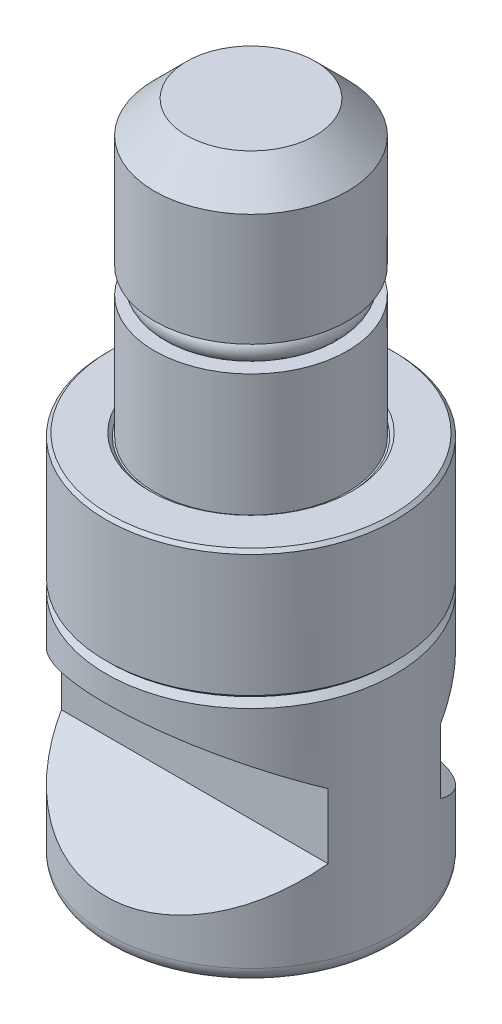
ISO-10303-21;
HEADER;
FILE_DESCRIPTION(('STEP AP214'),'2;1');
FILE_NAME('part.step','',(''),(''),'','','');
FILE_SCHEMA(('AUTOMOTIVE_DESIGN { 1 0 10303 214 1 1 1 1 }'));
ENDSEC;
DATA;
#1=APPLICATION_CONTEXT('core data for automotive mechanical design processes');
#2=APPLICATION_PROTOCOL_DEFINITION('international standard','automotive_design',2000,#1);
#3=PRODUCT_CONTEXT('',#1,'mechanical');
#4=PRODUCT('Part','Part','',(#3));
#5=PRODUCT_RELATED_PRODUCT_CATEGORY('part','',(#4));
#6=PRODUCT_DEFINITION_FORMATION('','',#4);
#7=PRODUCT_DEFINITION_CONTEXT('part definition',#1,'design');
#8=PRODUCT_DEFINITION('design','',#6,#7);
#9=PRODUCT_DEFINITION_SHAPE('','',#8);
#10=(LENGTH_UNIT() NAMED_UNIT(*) SI_UNIT(.MILLI.,.METRE.));
#11=(NAMED_UNIT(*) PLANE_ANGLE_UNIT() SI_UNIT($,.RADIAN.));
#12=(NAMED_UNIT(*) SI_UNIT($,.STERADIAN.) SOLID_ANGLE_UNIT());
#13=UNCERTAINTY_MEASURE_WITH_UNIT(LENGTH_MEASURE(1.E-05),#10,'distance_accuracy_value','');
#14=(GEOMETRIC_REPRESENTATION_CONTEXT(3) GLOBAL_UNCERTAINTY_ASSIGNED_CONTEXT((#13)) GLOBAL_UNIT_ASSIGNED_CONTEXT((#10,
#11,#12)) REPRESENTATION_CONTEXT('',''));
#15=CARTESIAN_POINT('',(0.,0.,0.));
#16=DIRECTION('',(0.,0.,1.));
#17=DIRECTION('',(1.,0.,0.));
#18=AXIS2_PLACEMENT_3D('',#15,#16,#17);
#19=CARTESIAN_POINT('',(6.1,0.,0.));
#20=DIRECTION('',(0.,-1.,0.));
#21=DIRECTION('',(0.,0.,-1.));
#22=AXIS2_PLACEMENT_3D('',#19,#20,#21);
#23=PLANE('',#22);
#24=CARTESIAN_POINT('',(0.,0.,0.));
#25=DIRECTION('',(0.,-1.,0.));
#26=DIRECTION('',(0.,0.,-1.));
#27=AXIS2_PLACEMENT_3D('',#24,#25,#26);
#28=CIRCLE('',#27,8.8);
#29=CARTESIAN_POINT('',(0.,0.,-8.8));
#30=VERTEX_POINT('',#29);
#31=EDGE_CURVE('E292',#30,#30,#28,.T.);
#32=ORIENTED_EDGE('',*,*,#31,.T.);
#33=EDGE_LOOP('',(#32));
#34=FACE_BOUND('',#33,.T.);
#35=CARTESIAN_POINT('',(0.,0.,0.));
#36=DIRECTION('',(0.,1.,0.));
#37=DIRECTION('',(0.,0.,-1.));
#38=AXIS2_PLACEMENT_3D('',#35,#36,#37);
#39=CIRCLE('',#38,8.5);
#40=CARTESIAN_POINT('',(0.,0.,-8.5));
#41=VERTEX_POINT('',#40);
#42=EDGE_CURVE('E177',#41,#41,#39,.T.);
#43=ORIENTED_EDGE('',*,*,#42,.T.);
#44=EDGE_LOOP('',(#43));
#45=FACE_BOUND('',#44,.T.);
#46=ADVANCED_FACE('F16',(#34,#45),#23,.T.);
#47=CARTESIAN_POINT('',(0.,8.,0.));
#48=DIRECTION('',(0.,-1.,0.));
#49=DIRECTION('',(0.,0.,-1.));
#50=AXIS2_PLACEMENT_3D('',#47,#48,#49);
#51=CYLINDRICAL_SURFACE('',#50,9.);
#52=CARTESIAN_POINT('',(0.,0.2,0.));
#53=DIRECTION('',(0.,-1.,0.));
#54=DIRECTION('',(0.,0.,-1.));
#55=AXIS2_PLACEMENT_3D('',#52,#53,#54);
#56=CIRCLE('',#55,9.);
#57=CARTESIAN_POINT('',(0.,0.2,-9.));
#58=VERTEX_POINT('',#57);
#59=EDGE_CURVE('E300',#58,#58,#56,.F.);
#60=ORIENTED_EDGE('',*,*,#59,.T.);
#61=EDGE_LOOP('',(#60));
#62=FACE_BOUND('',#61,.T.);
#63=CARTESIAN_POINT('',(0.,7.8,0.));
#64=DIRECTION('',(0.,1.,0.));
#65=DIRECTION('',(0.,0.,1.));
#66=AXIS2_PLACEMENT_3D('',#63,#64,#65);
#67=CIRCLE('',#66,9.);
#68=CARTESIAN_POINT('',(0.,7.8,9.));
#69=VERTEX_POINT('',#68);
#70=EDGE_CURVE('E288',#69,#69,#67,.F.);
#71=ORIENTED_EDGE('',*,*,#70,.T.);
#72=EDGE_LOOP('',(#71));
#73=FACE_BOUND('',#72,.T.);
#74=ADVANCED_FACE('F257',(#62,#73),#51,.T.);
#75=CARTESIAN_POINT('',(6.1,8.,0.));
#76=DIRECTION('',(0.,1.,0.));
#77=DIRECTION('',(0.,0.,1.));
#78=AXIS2_PLACEMENT_3D('',#75,#76,#77);
#79=PLANE('',#78);
#80=CARTESIAN_POINT('',(0.,8.,0.));
#81=DIRECTION('',(0.,1.,0.));
#82=DIRECTION('',(0.,0.,1.));
#83=AXIS2_PLACEMENT_3D('',#80,#81,#82);
#84=CIRCLE('',#83,8.8);
#85=CARTESIAN_POINT('',(0.,8.,8.8));
#86=VERTEX_POINT('',#85);
#87=EDGE_CURVE('E285',#86,#86,#84,.T.);
#88=ORIENTED_EDGE('',*,*,#87,.T.);
#89=EDGE_LOOP('',(#88));
#90=FACE_BOUND('',#89,.T.);
#91=CARTESIAN_POINT('',(0.,8.,0.));
#92=DIRECTION('',(0.,1.,0.));
#93=DIRECTION('',(0.,0.,1.));
#94=AXIS2_PLACEMENT_3D('',#91,#92,#93);
#95=CIRCLE('',#94,6.3);
#96=CARTESIAN_POINT('',(0.,8.,6.3));
#97=VERTEX_POINT('',#96);
#98=EDGE_CURVE('E295',#97,#97,#95,.F.);
#99=ORIENTED_EDGE('',*,*,#98,.T.);
#100=EDGE_LOOP('',(#99));
#101=FACE_BOUND('',#100,.T.);
#102=ADVANCED_FACE('F264',(#90,#101),#79,.T.);
#103=CARTESIAN_POINT('',(0.,8.,0.));
#104=DIRECTION('',(0.,1.,0.));
#105=DIRECTION('',(0.,0.,1.));
#106=AXIS2_PLACEMENT_3D('',#103,#104,#105);
#107=CONICAL_SURFACE('',#106,6.3,0.785398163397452);
#108=CARTESIAN_POINT('',(0.,7.8,0.));
#109=DIRECTION('',(0.,1.,0.));
#110=DIRECTION('',(0.,0.,1.));
#111=AXIS2_PLACEMENT_3D('',#108,#109,#110);
#112=CIRCLE('',#111,6.1);
#113=CARTESIAN_POINT('',(0.,7.8,6.1));
#114=VERTEX_POINT('',#113);
#115=EDGE_CURVE('E290',#114,#114,#112,.T.);
#116=ORIENTED_EDGE('',*,*,#115,.F.);
#117=EDGE_LOOP('',(#116));
#118=FACE_BOUND('',#117,.T.);
#119=ORIENTED_EDGE('',*,*,#98,.F.);
#120=EDGE_LOOP('',(#119));
#121=FACE_BOUND('',#120,.T.);
#122=ADVANCED_FACE('F271',(#118,#121),#107,.F.);
#123=CARTESIAN_POINT('',(0.,7.8,0.));
#124=DIRECTION('',(0.,-1.,0.));
#125=DIRECTION('',(0.,0.,-1.));
#126=AXIS2_PLACEMENT_3D('',#123,#124,#125);
#127=CONICAL_SURFACE('',#126,9.,0.785398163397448);
#128=ORIENTED_EDGE('',*,*,#87,.F.);
#129=EDGE_LOOP('',(#128));
#130=FACE_BOUND('',#129,.T.);
#131=ORIENTED_EDGE('',*,*,#70,.F.);
#132=EDGE_LOOP('',(#131));
#133=FACE_BOUND('',#132,.T.);
#134=ADVANCED_FACE('F273',(#130,#133),#127,.T.);
#135=CARTESIAN_POINT('',(0.,0.,0.));
#136=DIRECTION('',(0.,1.,0.));
#137=DIRECTION('',(0.,0.,1.));
#138=AXIS2_PLACEMENT_3D('',#135,#136,#137);
#139=CONICAL_SURFACE('',#138,8.8,0.785398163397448);
#140=ORIENTED_EDGE('',*,*,#59,.F.);
#141=EDGE_LOOP('',(#140));
#142=FACE_BOUND('',#141,.T.);
#143=ORIENTED_EDGE('',*,*,#31,.F.);
#144=EDGE_LOOP('',(#143));
#145=FACE_BOUND('',#144,.T.);
#146=ADVANCED_FACE('F196',(#142,#145),#139,.T.);
#147=CARTESIAN_POINT('',(0.,-12.,0.));
#148=DIRECTION('',(0.,-1.,0.));
#149=DIRECTION('',(0.,0.,1.));
#150=AXIS2_PLACEMENT_3D('',#147,#148,#149);
#151=PLANE('',#150);
#152=DIRECTION('',(0.,0.,1.));
#153=VECTOR('',#152,1.);
#154=CARTESIAN_POINT('',(2.5,-12.,-1.44337567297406));
#155=LINE('',#154,#153);
#156=CARTESIAN_POINT('',(2.5,-12.,-1.44337567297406));
#157=VERTEX_POINT('',#156);
#158=CARTESIAN_POINT('',(2.5,-12.,1.44337567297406));
#159=VERTEX_POINT('',#158);
#160=EDGE_CURVE('E120',#157,#159,#155,.T.);
#161=ORIENTED_EDGE('',*,*,#160,.T.);
#162=DIRECTION('',(-0.866025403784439,0.,0.5));
#163=VECTOR('',#162,1.);
#164=CARTESIAN_POINT('',(2.5,-12.,1.44337567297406));
#165=LINE('',#164,#163);
#166=CARTESIAN_POINT('',(0.,-12.,2.88675134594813));
#167=VERTEX_POINT('',#166);
#168=EDGE_CURVE('E113',#159,#167,#165,.T.);
#169=ORIENTED_EDGE('',*,*,#168,.T.);
#170=DIRECTION('',(-0.866025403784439,0.,-0.5));
#171=VECTOR('',#170,1.);
#172=CARTESIAN_POINT('',(0.,-12.,2.88675134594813));
#173=LINE('',#172,#171);
#174=CARTESIAN_POINT('',(-2.5,-12.,1.44337567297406));
#175=VERTEX_POINT('',#174);
#176=EDGE_CURVE('E117',#167,#175,#173,.T.);
#177=ORIENTED_EDGE('',*,*,#176,.T.);
#178=DIRECTION('',(0.,0.,-1.));
#179=VECTOR('',#178,1.);
#180=CARTESIAN_POINT('',(-2.5,-12.,1.44337567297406));
#181=LINE('',#180,#179);
#182=CARTESIAN_POINT('',(-2.5,-12.,-1.44337567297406));
#183=VERTEX_POINT('',#182);
#184=EDGE_CURVE('E325',#175,#183,#181,.T.);
#185=ORIENTED_EDGE('',*,*,#184,.T.);
#186=DIRECTION('',(0.866025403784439,0.,-0.5));
#187=VECTOR('',#186,1.);
#188=CARTESIAN_POINT('',(-2.5,-12.,-1.44337567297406));
#189=LINE('',#188,#187);
#190=CARTESIAN_POINT('',(0.,-12.,-2.88675134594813));
#191=VERTEX_POINT('',#190);
#192=EDGE_CURVE('E323',#183,#191,#189,.T.);
#193=ORIENTED_EDGE('',*,*,#192,.T.);
#194=DIRECTION('',(0.866025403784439,0.,0.5));
#195=VECTOR('',#194,1.);
#196=CARTESIAN_POINT('',(0.,-12.,-2.88675134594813));
#197=LINE('',#196,#195);
#198=EDGE_CURVE('E124',#191,#157,#197,.T.);
#199=ORIENTED_EDGE('',*,*,#198,.T.);
#200=EDGE_LOOP('',(#161,#169,#177,#185,#193,#199));
#201=FACE_BOUND('',#200,.T.);
#202=ADVANCED_FACE('F198',(#201),#151,.T.);
#203=CARTESIAN_POINT('',(0.,-12.,2.88675134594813));
#204=DIRECTION('',(-0.5,0.,0.866025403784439));
#205=DIRECTION('',(0.866025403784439,0.,0.5));
#206=AXIS2_PLACEMENT_3D('',#203,#204,#205);
#207=PLANE('',#206);
#208=CARTESIAN_POINT('',(-2.5002,-15.3192124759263,1.44326020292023));
#209=CARTESIAN_POINT('',(-2.39033676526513,-15.2825764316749,1.50668977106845));
#210=CARTESIAN_POINT('',(-2.27952520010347,-15.2492570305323,1.57066685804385));
#211=CARTESIAN_POINT('',(-2.05598316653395,-15.1910970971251,1.69972891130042));
#212=CARTESIAN_POINT('',(-1.94324872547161,-15.166277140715,1.7648161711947));
#213=CARTESIAN_POINT('',(-1.71917700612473,-15.1276404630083,1.8941840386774));
#214=CARTESIAN_POINT('',(-1.60787420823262,-15.1135666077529,1.95844473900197));
#215=CARTESIAN_POINT('',(-1.38474477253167,-15.09676396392,2.08726857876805));
#216=CARTESIAN_POINT('',(-1.27291894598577,-15.0940212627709,2.15183124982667));
#217=CARTESIAN_POINT('',(-1.06395802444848,-15.0997205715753,2.27247489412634));
#218=CARTESIAN_POINT('',(-0.966791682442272,-15.1067632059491,2.32857390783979));
#219=CARTESIAN_POINT('',(-0.773092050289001,-15.1290862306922,2.44040644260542));
#220=CARTESIAN_POINT('',(-0.676559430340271,-15.1443742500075,2.49613957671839));
#221=CARTESIAN_POINT('',(-0.482460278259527,-15.1825939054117,2.60820277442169));
#222=CARTESIAN_POINT('',(-0.384918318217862,-15.2056875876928,2.66451865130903));
#223=CARTESIAN_POINT('',(-0.191289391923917,-15.2581014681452,2.77631036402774));
#224=CARTESIAN_POINT('',(-0.0951999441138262,-15.2874093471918,2.83178763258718));
#225=CARTESIAN_POINT('',(0.00019999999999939,-15.3192124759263,2.88686681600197));
#226=B_SPLINE_CURVE_WITH_KNOTS('',3,(#208,#209,#210,#211,#212,#213,#214,#215,#216,#217,#218,
#219,#220,#221,#222,#223,#224,#225),.UNSPECIFIED.,.F.,.F.,(4,2,2,2,2,2,2,2,4),(0.,
0.396285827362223,0.793524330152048,1.18093086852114,1.56786160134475,1.90479741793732,
2.24204551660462,2.58677531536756,2.93082800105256),.UNSPECIFIED.);
#227=CARTESIAN_POINT('',(-2.5,-15.3191458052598,1.44337567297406));
#228=VERTEX_POINT('',#227);
#229=CARTESIAN_POINT('',(0.,-15.3191458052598,2.88675134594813));
#230=VERTEX_POINT('',#229);
#231=EDGE_CURVE('E92',#228,#230,#226,.T.);
#232=ORIENTED_EDGE('',*,*,#231,.F.);
#233=DIRECTION('',(0.,-1.,0.));
#234=VECTOR('',#233,1.);
#235=CARTESIAN_POINT('',(-2.5,-12.,1.44337567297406));
#236=LINE('',#235,#234);
#237=EDGE_CURVE('E119',#175,#228,#236,.T.);
#238=ORIENTED_EDGE('',*,*,#237,.F.);
#239=ORIENTED_EDGE('',*,*,#176,.F.);
#240=DIRECTION('',(0.,-1.,0.));
#241=VECTOR('',#240,1.);
#242=CARTESIAN_POINT('',(0.,-12.,2.88675134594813));
#243=LINE('',#242,#241);
#244=EDGE_CURVE('E110',#167,#230,#243,.T.);
#245=ORIENTED_EDGE('',*,*,#244,.T.);
#246=EDGE_LOOP('',(#232,#238,#239,#245));
#247=FACE_BOUND('',#246,.T.);
#248=ADVANCED_FACE('F116',(#247),#207,.F.);
#249=CARTESIAN_POINT('',(-2.5,-12.,1.44337567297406));
#250=DIRECTION('',(-1.,0.,0.));
#251=DIRECTION('',(0.,1.,0.));
#252=AXIS2_PLACEMENT_3D('',#249,#250,#251);
#253=PLANE('',#252);
#254=CARTESIAN_POINT('',(-2.5,-16.5534184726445,-4.35847990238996));
#255=CARTESIAN_POINT('',(-2.5,-16.5012419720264,-4.25428000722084));
#256=CARTESIAN_POINT('',(-2.5,-16.4494226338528,-4.14989938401));
#257=CARTESIAN_POINT('',(-2.5,-16.3466728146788,-3.94069776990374));
#258=CARTESIAN_POINT('',(-2.5,-16.295742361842,-3.83587676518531));
#259=CARTESIAN_POINT('',(-2.5,-16.1948473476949,-3.62551184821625));
#260=CARTESIAN_POINT('',(-2.5,-16.1448849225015,-3.51996690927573));
#261=CARTESIAN_POINT('',(-2.5,-16.0462694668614,-3.30826399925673));
#262=CARTESIAN_POINT('',(-2.5,-15.9976164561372,-3.20210601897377));
#263=CARTESIAN_POINT('',(-2.5,-15.8997579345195,-2.98423916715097));
#264=CARTESIAN_POINT('',(-2.5,-15.8506271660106,-2.87249661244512));
#265=CARTESIAN_POINT('',(-2.5,-15.7545858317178,-2.64806241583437));
#266=CARTESIAN_POINT('',(-2.5,-15.7076751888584,-2.5353708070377));
#267=CARTESIAN_POINT('',(-2.5,-15.616706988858,-2.30893569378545));
#268=CARTESIAN_POINT('',(-2.5,-15.5726472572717,-2.1951930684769));
#269=CARTESIAN_POINT('',(-2.5,-15.4881215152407,-1.9663375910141));
#270=CARTESIAN_POINT('',(-2.5,-15.4476565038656,-1.85122436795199));
#271=CARTESIAN_POINT('',(-2.5,-15.3625020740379,-1.59257909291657));
#272=CARTESIAN_POINT('',(-2.5,-15.3190084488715,-1.44864606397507));
#273=CARTESIAN_POINT('',(-2.5,-15.2415121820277,-1.15827909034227));
#274=CARTESIAN_POINT('',(-2.5,-15.2075039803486,-1.01184666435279));
#275=CARTESIAN_POINT('',(-2.5,-15.1522899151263,-0.719069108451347));
#276=CARTESIAN_POINT('',(-2.5,-15.1308779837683,-0.572764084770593));
#277=CARTESIAN_POINT('',(-2.5,-15.1023968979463,-0.27877244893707));
#278=CARTESIAN_POINT('',(-2.5,-15.0953215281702,-0.131086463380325));
#279=CARTESIAN_POINT('',(-2.5,-15.0964550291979,0.16514819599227));
#280=CARTESIAN_POINT('',(-2.5,-15.1047596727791,0.313696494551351));
#281=CARTESIAN_POINT('',(-2.5,-15.1357234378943,0.609297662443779));
#282=CARTESIAN_POINT('',(-2.5,-15.1583892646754,0.756349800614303));
#283=CARTESIAN_POINT('',(-2.5,-15.2160393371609,1.05056792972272));
#284=CARTESIAN_POINT('',(-2.5,-15.2512284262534,1.1976925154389));
#285=CARTESIAN_POINT('',(-2.5,-15.330952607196,1.48941876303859));
#286=CARTESIAN_POINT('',(-2.5,-15.3754930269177,1.63401893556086));
#287=CARTESIAN_POINT('',(-2.5,-15.461577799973,1.89132457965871));
#288=CARTESIAN_POINT('',(-2.5,-15.501849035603,2.00446376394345));
#289=CARTESIAN_POINT('',(-2.5,-15.5857846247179,2.2294350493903));
#290=CARTESIAN_POINT('',(-2.5,-15.6294480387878,2.34126750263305));
#291=CARTESIAN_POINT('',(-2.5,-15.7194736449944,2.56392567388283));
#292=CARTESIAN_POINT('',(-2.5,-15.7658377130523,2.67475062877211));
#293=CARTESIAN_POINT('',(-2.5,-15.8606795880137,2.89549327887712));
#294=CARTESIAN_POINT('',(-2.5,-15.9091574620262,3.0054109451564));
#295=CARTESIAN_POINT('',(-2.5,-16.0056907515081,3.21980106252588));
#296=CARTESIAN_POINT('',(-2.5,-16.0536756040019,3.32430538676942));
#297=CARTESIAN_POINT('',(-2.5,-16.1509034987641,3.532724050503));
#298=CARTESIAN_POINT('',(-2.5,-16.200146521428,3.63663839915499));
#299=CARTESIAN_POINT('',(-2.5,-16.2995748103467,3.84378201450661));
#300=CARTESIAN_POINT('',(-2.5,-16.3497582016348,3.94701218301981));
#301=CARTESIAN_POINT('',(-2.5,-16.4509849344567,4.15304668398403));
#302=CARTESIAN_POINT('',(-2.5,-16.5020282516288,4.25585102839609));
#303=CARTESIAN_POINT('',(-2.5,-16.5534184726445,4.35847990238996));
#304=B_SPLINE_CURVE_WITH_KNOTS('',3,(#254,#255,#256,#257,#258,#259,#260,#261,#262,#263,#264,
#265,#266,#267,#268,#269,#270,#271,#272,#273,#274,#275,#276,#277,#278,#279,#280,#281,#282,#283,
#284,#285,#286,#287,#288,#289,#290,#291,#292,#293,#294,#295,#296,#297,#298,#299,#300,#301,#302,
#303),.UNSPECIFIED.,.F.,.F.,(4,2,2,2,2,2,2,2,2,2,2,2,2,2,2,2,2,2,2,2,2,2,2,2,4),(0.,
0.349601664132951,0.699214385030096,1.04952651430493,1.39984391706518,1.76602436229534,
2.13219208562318,2.49807715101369,2.86406358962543,3.31490521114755,3.76548200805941,
4.208466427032,4.65125875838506,5.09681767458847,5.54258477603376,5.99600640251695,
6.44968706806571,6.80990389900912,7.17002132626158,7.5303919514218,7.89077402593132,
8.23574717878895,8.58071495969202,8.92505583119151,9.26938696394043),.UNSPECIFIED.);
#305=CARTESIAN_POINT('',(-2.5,-15.3191458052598,-1.44337567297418));
#306=VERTEX_POINT('',#305);
#307=EDGE_CURVE('E98',#306,#228,#304,.T.);
#308=ORIENTED_EDGE('',*,*,#307,.F.);
#309=DIRECTION('',(0.,-1.,0.));
#310=VECTOR('',#309,1.);
#311=CARTESIAN_POINT('',(-2.5,-12.,-1.44337567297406));
#312=LINE('',#311,#310);
#313=EDGE_CURVE('E122',#183,#306,#312,.T.);
#314=ORIENTED_EDGE('',*,*,#313,.F.);
#315=ORIENTED_EDGE('',*,*,#184,.F.);
#316=ORIENTED_EDGE('',*,*,#237,.T.);
#317=EDGE_LOOP('',(#308,#314,#315,#316));
#318=FACE_BOUND('',#317,.T.);
#319=ADVANCED_FACE('F246',(#318),#253,.F.);
#320=CARTESIAN_POINT('',(-2.5,-12.,-1.44337567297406));
#321=DIRECTION('',(-0.5,0.,-0.866025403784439));
#322=DIRECTION('',(-0.866025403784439,0.,0.5));
#323=AXIS2_PLACEMENT_3D('',#320,#321,#322);
#324=PLANE('',#323);
#325=CARTESIAN_POINT('',(0.000199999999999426,-15.3192124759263,-2.88686681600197));
#326=CARTESIAN_POINT('',(-0.109663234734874,-15.2825764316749,-2.82343724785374));
#327=CARTESIAN_POINT('',(-0.220474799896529,-15.2492570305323,-2.75946016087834));
#328=CARTESIAN_POINT('',(-0.444016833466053,-15.1910970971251,-2.63039810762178));
#329=CARTESIAN_POINT('',(-0.556751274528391,-15.166277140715,-2.5653108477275));
#330=CARTESIAN_POINT('',(-0.780822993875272,-15.1276404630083,-2.43594298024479));
#331=CARTESIAN_POINT('',(-0.89212579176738,-15.1135666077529,-2.37168227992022));
#332=CARTESIAN_POINT('',(-1.11525522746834,-15.09676396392,-2.24285844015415));
#333=CARTESIAN_POINT('',(-1.22708105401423,-15.0940212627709,-2.17829576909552));
#334=CARTESIAN_POINT('',(-1.43604197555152,-15.0997205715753,-2.05765212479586));
#335=CARTESIAN_POINT('',(-1.53320831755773,-15.1067632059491,-2.0015531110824));
#336=CARTESIAN_POINT('',(-1.726907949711,-15.1290862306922,-1.88972057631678));
#337=CARTESIAN_POINT('',(-1.82344056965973,-15.1443742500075,-1.8339874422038));
#338=CARTESIAN_POINT('',(-2.01753972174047,-15.1825939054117,-1.7219242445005));
#339=CARTESIAN_POINT('',(-2.11508168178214,-15.2056875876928,-1.66560836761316));
#340=CARTESIAN_POINT('',(-2.30871060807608,-15.2581014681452,-1.55381665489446));
#341=CARTESIAN_POINT('',(-2.40480005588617,-15.2874093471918,-1.49833938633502));
#342=CARTESIAN_POINT('',(-2.5002,-15.3192124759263,-1.44326020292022));
#343=B_SPLINE_CURVE_WITH_KNOTS('',3,(#325,#326,#327,#328,#329,#330,#331,#332,#333,#334,#335,
#336,#337,#338,#339,#340,#341,#342),.UNSPECIFIED.,.F.,.F.,(4,2,2,2,2,2,2,2,4),(0.,
0.396285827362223,0.793524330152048,1.18093086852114,1.56786160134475,1.90479741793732,
2.24204551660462,2.58677531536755,2.93082800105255),.UNSPECIFIED.);
#344=CARTESIAN_POINT('',(0.,-15.3191458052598,-2.88675134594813));
#345=VERTEX_POINT('',#344);
#346=EDGE_CURVE('E212',#345,#306,#343,.T.);
#347=ORIENTED_EDGE('',*,*,#346,.F.);
#348=DIRECTION('',(0.,-1.,0.));
#349=VECTOR('',#348,1.);
#350=CARTESIAN_POINT('',(0.,-12.,-2.88675134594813));
#351=LINE('',#350,#349);
#352=EDGE_CURVE('E314',#191,#345,#351,.T.);
#353=ORIENTED_EDGE('',*,*,#352,.F.);
#354=ORIENTED_EDGE('',*,*,#192,.F.);
#355=ORIENTED_EDGE('',*,*,#313,.T.);
#356=EDGE_LOOP('',(#347,#353,#354,#355));
#357=FACE_BOUND('',#356,.T.);
#358=ADVANCED_FACE('F242',(#357),#324,.F.);
#359=CARTESIAN_POINT('',(0.,-12.,-2.88675134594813));
#360=DIRECTION('',(0.5,0.,-0.866025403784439));
#361=DIRECTION('',(-0.866025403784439,0.,-0.5));
#362=AXIS2_PLACEMENT_3D('',#359,#360,#361);
#363=PLANE('',#362);
#364=CARTESIAN_POINT('',(2.5002,-15.3192124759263,-1.44326020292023));
#365=CARTESIAN_POINT('',(2.39033676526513,-15.2825764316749,-1.50668977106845));
#366=CARTESIAN_POINT('',(2.27952520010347,-15.2492570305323,-1.57066685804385));
#367=CARTESIAN_POINT('',(2.05598316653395,-15.1910970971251,-1.69972891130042));
#368=CARTESIAN_POINT('',(1.94324872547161,-15.166277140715,-1.7648161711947));
#369=CARTESIAN_POINT('',(1.71917700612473,-15.1276404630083,-1.8941840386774));
#370=CARTESIAN_POINT('',(1.60787420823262,-15.1135666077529,-1.95844473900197));
#371=CARTESIAN_POINT('',(1.38474477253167,-15.09676396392,-2.08726857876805));
#372=CARTESIAN_POINT('',(1.27291894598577,-15.0940212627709,-2.15183124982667));
#373=CARTESIAN_POINT('',(1.06395802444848,-15.0997205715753,-2.27247489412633));
#374=CARTESIAN_POINT('',(0.966791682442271,-15.1067632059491,-2.32857390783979));
#375=CARTESIAN_POINT('',(0.773092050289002,-15.1290862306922,-2.44040644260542));
#376=CARTESIAN_POINT('',(0.676559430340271,-15.1443742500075,-2.49613957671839));
#377=CARTESIAN_POINT('',(0.482460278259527,-15.1825939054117,-2.60820277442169));
#378=CARTESIAN_POINT('',(0.384918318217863,-15.2056875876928,-2.66451865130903));
#379=CARTESIAN_POINT('',(0.191289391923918,-15.2581014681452,-2.77631036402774));
#380=CARTESIAN_POINT('',(0.0951999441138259,-15.2874093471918,-2.83178763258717));
#381=CARTESIAN_POINT('',(-0.000200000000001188,-15.3192124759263,-2.88686681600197));
#382=B_SPLINE_CURVE_WITH_KNOTS('',3,(#364,#365,#366,#367,#368,#369,#370,#371,#372,#373,#374,
#375,#376,#377,#378,#379,#380,#381),.UNSPECIFIED.,.F.,.F.,(4,2,2,2,2,2,2,2,4),(0.,
0.396285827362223,0.793524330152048,1.18093086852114,1.56786160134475,1.90479741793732,
2.24204551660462,2.58677531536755,2.93082800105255),.UNSPECIFIED.);
#383=CARTESIAN_POINT('',(2.5,-15.3191458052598,-1.44337567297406));
#384=VERTEX_POINT('',#383);
#385=EDGE_CURVE('E219',#384,#345,#382,.T.);
#386=ORIENTED_EDGE('',*,*,#385,.F.);
#387=DIRECTION('',(0.,-1.,0.));
#388=VECTOR('',#387,1.);
#389=CARTESIAN_POINT('',(2.5,-12.,-1.44337567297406));
#390=LINE('',#389,#388);
#391=EDGE_CURVE('E317',#157,#384,#390,.T.);
#392=ORIENTED_EDGE('',*,*,#391,.F.);
#393=ORIENTED_EDGE('',*,*,#198,.F.);
#394=ORIENTED_EDGE('',*,*,#352,.T.);
#395=EDGE_LOOP('',(#386,#392,#393,#394));
#396=FACE_BOUND('',#395,.T.);
#397=ADVANCED_FACE('F238',(#396),#363,.F.);
#398=CARTESIAN_POINT('',(2.5,-12.,-1.44337567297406));
#399=DIRECTION('',(1.,0.,0.));
#400=DIRECTION('',(0.,0.,-1.));
#401=AXIS2_PLACEMENT_3D('',#398,#399,#400);
#402=PLANE('',#401);
#403=CARTESIAN_POINT('',(2.5,-16.5534184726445,4.35847990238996));
#404=CARTESIAN_POINT('',(2.5,-16.5012419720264,4.25428000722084));
#405=CARTESIAN_POINT('',(2.5,-16.4494226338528,4.14989938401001));
#406=CARTESIAN_POINT('',(2.5,-16.3466728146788,3.94069776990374));
#407=CARTESIAN_POINT('',(2.5,-16.295742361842,3.83587676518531));
#408=CARTESIAN_POINT('',(2.5,-16.1948473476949,3.62551184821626));
#409=CARTESIAN_POINT('',(2.5,-16.1448849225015,3.51996690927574));
#410=CARTESIAN_POINT('',(2.5,-16.0462694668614,3.30826399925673));
#411=CARTESIAN_POINT('',(2.5,-15.9976164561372,3.20210601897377));
#412=CARTESIAN_POINT('',(2.5,-15.8997579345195,2.98423916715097));
#413=CARTESIAN_POINT('',(2.5,-15.8506271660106,2.87249661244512));
#414=CARTESIAN_POINT('',(2.5,-15.7545858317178,2.64806241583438));
#415=CARTESIAN_POINT('',(2.5,-15.7076751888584,2.5353708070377));
#416=CARTESIAN_POINT('',(2.5,-15.616706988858,2.30893569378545));
#417=CARTESIAN_POINT('',(2.5,-15.5726472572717,2.1951930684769));
#418=CARTESIAN_POINT('',(2.5,-15.4881215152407,1.9663375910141));
#419=CARTESIAN_POINT('',(2.5,-15.4476565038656,1.85122436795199));
#420=CARTESIAN_POINT('',(2.5,-15.3625020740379,1.59257909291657));
#421=CARTESIAN_POINT('',(2.5,-15.3190084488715,1.44864606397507));
#422=CARTESIAN_POINT('',(2.5,-15.2415121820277,1.15827909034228));
#423=CARTESIAN_POINT('',(2.5,-15.2075039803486,1.01184666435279));
#424=CARTESIAN_POINT('',(2.5,-15.1522899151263,0.71906910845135));
#425=CARTESIAN_POINT('',(2.5,-15.1308779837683,0.572764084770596));
#426=CARTESIAN_POINT('',(2.5,-15.1023968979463,0.278772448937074));
#427=CARTESIAN_POINT('',(2.5,-15.0953215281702,0.131086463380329));
#428=CARTESIAN_POINT('',(2.5,-15.0964550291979,-0.165148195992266));
#429=CARTESIAN_POINT('',(2.5,-15.1047596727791,-0.313696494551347));
#430=CARTESIAN_POINT('',(2.5,-15.1357234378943,-0.609297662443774));
#431=CARTESIAN_POINT('',(2.5,-15.1583892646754,-0.756349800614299));
#432=CARTESIAN_POINT('',(2.5,-15.2160393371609,-1.05056792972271));
#433=CARTESIAN_POINT('',(2.5,-15.2512284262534,-1.1976925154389));
#434=CARTESIAN_POINT('',(2.5,-15.330952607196,-1.48941876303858));
#435=CARTESIAN_POINT('',(2.5,-15.3754930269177,-1.63401893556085));
#436=CARTESIAN_POINT('',(2.5,-15.461577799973,-1.89132457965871));
#437=CARTESIAN_POINT('',(2.5,-15.501849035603,-2.00446376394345));
#438=CARTESIAN_POINT('',(2.5,-15.5857846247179,-2.2294350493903));
#439=CARTESIAN_POINT('',(2.5,-15.6294480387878,-2.34126750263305));
#440=CARTESIAN_POINT('',(2.5,-15.7194736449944,-2.56392567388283));
#441=CARTESIAN_POINT('',(2.5,-15.7658377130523,-2.67475062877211));
#442=CARTESIAN_POINT('',(2.5,-15.8606795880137,-2.89549327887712));
#443=CARTESIAN_POINT('',(2.5,-15.9091574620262,-3.0054109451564));
#444=CARTESIAN_POINT('',(2.5,-16.0056907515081,-3.21980106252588));
#445=CARTESIAN_POINT('',(2.5,-16.0536756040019,-3.32430538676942));
#446=CARTESIAN_POINT('',(2.5,-16.1509034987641,-3.532724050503));
#447=CARTESIAN_POINT('',(2.5,-16.200146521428,-3.63663839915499));
#448=CARTESIAN_POINT('',(2.5,-16.2995748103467,-3.84378201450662));
#449=CARTESIAN_POINT('',(2.5,-16.3497582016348,-3.94701218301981));
#450=CARTESIAN_POINT('',(2.5,-16.4509849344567,-4.15304668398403));
#451=CARTESIAN_POINT('',(2.5,-16.5020282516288,-4.2558510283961));
#452=CARTESIAN_POINT('',(2.5,-16.5534184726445,-4.35847990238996));
#453=B_SPLINE_CURVE_WITH_KNOTS('',3,(#403,#404,#405,#406,#407,#408,#409,#410,#411,#412,#413,
#414,#415,#416,#417,#418,#419,#420,#421,#422,#423,#424,#425,#426,#427,#428,#429,#430,#431,#432,
#433,#434,#435,#436,#437,#438,#439,#440,#441,#442,#443,#444,#445,#446,#447,#448,#449,#450,#451,
#452),.UNSPECIFIED.,.F.,.F.,(4,2,2,2,2,2,2,2,2,2,2,2,2,2,2,2,2,2,2,2,2,2,2,2,4),(0.,
0.349601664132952,0.699214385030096,1.04952651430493,1.39984391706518,1.76602436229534,
2.13219208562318,2.49807715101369,2.86406358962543,3.31490521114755,3.76548200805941,
4.208466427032,4.65125875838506,5.09681767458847,5.54258477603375,5.99600640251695,
6.4496870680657,6.80990389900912,7.17002132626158,7.5303919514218,7.89077402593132,
8.23574717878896,8.58071495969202,8.92505583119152,9.26938696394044),.UNSPECIFIED.);
#454=CARTESIAN_POINT('',(2.5,-15.3191458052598,1.44337567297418));
#455=VERTEX_POINT('',#454);
#456=EDGE_CURVE('E114',#455,#384,#453,.T.);
#457=ORIENTED_EDGE('',*,*,#456,.F.);
#458=DIRECTION('',(0.,-1.,0.));
#459=VECTOR('',#458,1.);
#460=CARTESIAN_POINT('',(2.5,-12.,1.44337567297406));
#461=LINE('',#460,#459);
#462=EDGE_CURVE('E112',#159,#455,#461,.T.);
#463=ORIENTED_EDGE('',*,*,#462,.F.);
#464=ORIENTED_EDGE('',*,*,#160,.F.);
#465=ORIENTED_EDGE('',*,*,#391,.T.);
#466=EDGE_LOOP('',(#457,#463,#464,#465));
#467=FACE_BOUND('',#466,.T.);
#468=ADVANCED_FACE('F235',(#467),#402,.F.);
#469=CARTESIAN_POINT('',(2.5,-12.,1.44337567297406));
#470=DIRECTION('',(0.5,0.,0.866025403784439));
#471=DIRECTION('',(0.866025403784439,0.,-0.5));
#472=AXIS2_PLACEMENT_3D('',#469,#470,#471);
#473=PLANE('',#472);
#474=CARTESIAN_POINT('',(-0.000200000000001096,-15.3192124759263,2.88686681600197));
#475=CARTESIAN_POINT('',(0.109663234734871,-15.2825764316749,2.82343724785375));
#476=CARTESIAN_POINT('',(0.220474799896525,-15.2492570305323,2.75946016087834));
#477=CARTESIAN_POINT('',(0.444016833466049,-15.1910970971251,2.63039810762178));
#478=CARTESIAN_POINT('',(0.556751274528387,-15.166277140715,2.5653108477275));
#479=CARTESIAN_POINT('',(0.780822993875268,-15.1276404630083,2.43594298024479));
#480=CARTESIAN_POINT('',(0.892125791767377,-15.1135666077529,2.37168227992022));
#481=CARTESIAN_POINT('',(1.11525522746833,-15.09676396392,2.24285844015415));
#482=CARTESIAN_POINT('',(1.22708105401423,-15.0940212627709,2.17829576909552));
#483=CARTESIAN_POINT('',(1.43604197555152,-15.0997205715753,2.05765212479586));
#484=CARTESIAN_POINT('',(1.53320831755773,-15.1067632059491,2.0015531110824));
#485=CARTESIAN_POINT('',(1.726907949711,-15.1290862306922,1.88972057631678));
#486=CARTESIAN_POINT('',(1.82344056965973,-15.1443742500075,1.8339874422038));
#487=CARTESIAN_POINT('',(2.01753972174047,-15.1825939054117,1.7219242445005));
#488=CARTESIAN_POINT('',(2.11508168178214,-15.2056875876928,1.66560836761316));
#489=CARTESIAN_POINT('',(2.30871060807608,-15.2581014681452,1.55381665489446));
#490=CARTESIAN_POINT('',(2.40480005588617,-15.2874093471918,1.49833938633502));
#491=CARTESIAN_POINT('',(2.5002,-15.3192124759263,1.44326020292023));
#492=B_SPLINE_CURVE_WITH_KNOTS('',3,(#474,#475,#476,#477,#478,#479,#480,#481,#482,#483,#484,
#485,#486,#487,#488,#489,#490,#491),.UNSPECIFIED.,.F.,.F.,(4,2,2,2,2,2,2,2,4),(0.,
0.396285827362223,0.793524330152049,1.18093086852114,1.56786160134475,1.90479741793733,
2.24204551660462,2.58677531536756,2.93082800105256),.UNSPECIFIED.);
#493=EDGE_CURVE('E95',#230,#455,#492,.T.);
#494=ORIENTED_EDGE('',*,*,#493,.F.);
#495=ORIENTED_EDGE('',*,*,#244,.F.);
#496=ORIENTED_EDGE('',*,*,#168,.F.);
#497=ORIENTED_EDGE('',*,*,#462,.T.);
#498=EDGE_LOOP('',(#494,#495,#496,#497));
#499=FACE_BOUND('',#498,.T.);
#500=ADVANCED_FACE('F108',(#499),#473,.F.);
#501=CARTESIAN_POINT('',(0.,-15.5,0.));
#502=DIRECTION('',(0.,-1.,0.));
#503=DIRECTION('',(0.,0.,1.));
#504=AXIS2_PLACEMENT_3D('',#501,#502,#503);
#505=CONICAL_SURFACE('',#504,3.2,1.0471975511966);
#506=CARTESIAN_POINT('',(0.,-15.5,0.));
#507=DIRECTION('',(0.,1.,0.));
#508=DIRECTION('',(0.,0.,-1.));
#509=AXIS2_PLACEMENT_3D('',#506,#507,#508);
#510=CIRCLE('',#509,3.2);
#511=CARTESIAN_POINT('',(0.,-15.5,-3.2));
#512=VERTEX_POINT('',#511);
#513=EDGE_CURVE('E302',#512,#512,#510,.T.);
#514=ORIENTED_EDGE('',*,*,#513,.F.);
#515=EDGE_LOOP('',(#514));
#516=FACE_BOUND('',#515,.T.);
#517=ORIENTED_EDGE('',*,*,#493,.T.);
#518=ORIENTED_EDGE('',*,*,#456,.T.);
#519=ORIENTED_EDGE('',*,*,#385,.T.);
#520=ORIENTED_EDGE('',*,*,#346,.T.);
#521=ORIENTED_EDGE('',*,*,#307,.T.);
#522=ORIENTED_EDGE('',*,*,#231,.T.);
#523=EDGE_LOOP('',(#517,#518,#519,#520,#521,#522));
#524=FACE_BOUND('',#523,.T.);
#525=ADVANCED_FACE('F94',(#516,#524),#505,.F.);
#526=CARTESIAN_POINT('',(9.,-15.5,0.));
#527=DIRECTION('',(0.,-1.,0.));
#528=DIRECTION('',(-1.,0.,0.));
#529=AXIS2_PLACEMENT_3D('',#526,#527,#528);
#530=PLANE('',#529);
#531=ORIENTED_EDGE('',*,*,#513,.T.);
#532=EDGE_LOOP('',(#531));
#533=FACE_BOUND('',#532,.T.);
#534=CARTESIAN_POINT('',(0.,-15.5,0.));
#535=DIRECTION('',(0.,-1.,0.));
#536=DIRECTION('',(-1.,0.,0.));
#537=AXIS2_PLACEMENT_3D('',#534,#535,#536);
#538=CIRCLE('',#537,8.);
#539=CARTESIAN_POINT('',(-8.,-15.5,0.));
#540=VERTEX_POINT('',#539);
#541=EDGE_CURVE('E174',#540,#540,#538,.T.);
#542=ORIENTED_EDGE('',*,*,#541,.T.);
#543=EDGE_LOOP('',(#542));
#544=FACE_BOUND('',#543,.T.);
#545=ADVANCED_FACE('F194',(#533,#544),#530,.T.);
#546=CARTESIAN_POINT('',(15.,-9.32457351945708,3.5));
#547=DIRECTION('',(0.,-0.86602540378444,-0.5));
#548=DIRECTION('',(0.,-0.5,0.866025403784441));
#549=AXIS2_PLACEMENT_3D('',#546,#547,#548);
#550=PLANE('',#549);
#551=CARTESIAN_POINT('',(0.,-7.30384757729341,0.));
#552=DIRECTION('',(0.,-0.86602540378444,-0.5));
#553=DIRECTION('',(0.,0.5,-0.866025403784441));
#554=AXIS2_PLACEMENT_3D('',#551,#552,#553);
#555=ELLIPSE('',#554,10.3923048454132,9.);
#556=CARTESIAN_POINT('',(8.2915619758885,-9.32457351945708,3.5));
#557=VERTEX_POINT('',#556);
#558=CARTESIAN_POINT('',(-8.2915619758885,-9.32457351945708,3.5));
#559=VERTEX_POINT('',#558);
#560=EDGE_CURVE('E135',#557,#559,#555,.T.);
#561=ORIENTED_EDGE('',*,*,#560,.F.);
#562=DIRECTION('',(-1.,0.,0.));
#563=VECTOR('',#562,1.);
#564=CARTESIAN_POINT('',(15.,-9.32457351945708,3.5));
#565=LINE('',#564,#563);
#566=EDGE_CURVE('E155',#557,#559,#565,.T.);
#567=ORIENTED_EDGE('',*,*,#566,.T.);
#568=EDGE_LOOP('',(#561,#567));
#569=FACE_BOUND('',#568,.T.);
#570=ADVANCED_FACE('F376',(#569),#550,.F.);
#571=CARTESIAN_POINT('',(15.,-5.27542648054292,3.5));
#572=DIRECTION('',(0.,0.,-1.));
#573=DIRECTION('',(0.,-1.,0.));
#574=AXIS2_PLACEMENT_3D('',#571,#572,#573);
#575=PLANE('',#574);
#576=DIRECTION('',(0.,1.,0.));
#577=VECTOR('',#576,1.);
#578=CARTESIAN_POINT('',(-8.2915619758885,-13.625,3.5));
#579=LINE('',#578,#577);
#580=CARTESIAN_POINT('',(-8.2915619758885,-5.27542648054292,3.5));
#581=VERTEX_POINT('',#580);
#582=EDGE_CURVE('E138',#559,#581,#579,.T.);
#583=ORIENTED_EDGE('',*,*,#582,.F.);
#584=ORIENTED_EDGE('',*,*,#566,.F.);
#585=DIRECTION('',(0.,1.,0.));
#586=VECTOR('',#585,1.);
#587=CARTESIAN_POINT('',(8.2915619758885,-13.625,3.5));
#588=LINE('',#587,#586);
#589=CARTESIAN_POINT('',(8.2915619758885,-5.27542648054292,3.5));
#590=VERTEX_POINT('',#589);
#591=EDGE_CURVE('E31',#590,#557,#588,.F.);
#592=ORIENTED_EDGE('',*,*,#591,.F.);
#593=DIRECTION('',(-1.,0.,0.));
#594=VECTOR('',#593,1.);
#595=CARTESIAN_POINT('',(15.,-5.27542648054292,3.5));
#596=LINE('',#595,#594);
#597=EDGE_CURVE('E158',#590,#581,#596,.T.);
#598=ORIENTED_EDGE('',*,*,#597,.T.);
#599=EDGE_LOOP('',(#583,#584,#592,#598));
#600=FACE_BOUND('',#599,.T.);
#601=ADVANCED_FACE('F406',(#600),#575,.F.);
#602=CARTESIAN_POINT('',(15.,-1.81132486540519,9.5));
#603=DIRECTION('',(0.,0.866025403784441,-0.5));
#604=DIRECTION('',(0.,-0.5,-0.86602540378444));
#605=AXIS2_PLACEMENT_3D('',#602,#603,#604);
#606=PLANE('',#605);
#607=CARTESIAN_POINT('',(0.,-7.29615242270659,0.));
#608=DIRECTION('',(0.,0.866025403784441,-0.5));
#609=DIRECTION('',(0.,0.5,0.86602540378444));
#610=AXIS2_PLACEMENT_3D('',#607,#608,#609);
#611=ELLIPSE('',#610,10.3923048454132,9.);
#612=EDGE_CURVE('E140',#581,#590,#611,.T.);
#613=ORIENTED_EDGE('',*,*,#612,.F.);
#614=ORIENTED_EDGE('',*,*,#597,.F.);
#615=EDGE_LOOP('',(#613,#614));
#616=FACE_BOUND('',#615,.T.);
#617=ADVANCED_FACE('F410',(#616),#606,.F.);
#618=CARTESIAN_POINT('',(15.,-9.32457351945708,-3.5));
#619=DIRECTION('',(0.,0.866025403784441,-0.5));
#620=DIRECTION('',(0.,-0.5,-0.866025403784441));
#621=AXIS2_PLACEMENT_3D('',#618,#619,#620);
#622=PLANE('',#621);
#623=DIRECTION('',(-1.,0.,0.));
#624=VECTOR('',#623,1.);
#625=CARTESIAN_POINT('',(15.,-9.32457351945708,-3.5));
#626=LINE('',#625,#624);
#627=CARTESIAN_POINT('',(8.2915619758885,-9.32457351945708,-3.5));
#628=VERTEX_POINT('',#627);
#629=CARTESIAN_POINT('',(-8.2915619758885,-9.32457351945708,-3.5));
#630=VERTEX_POINT('',#629);
#631=EDGE_CURVE('E152',#628,#630,#626,.T.);
#632=ORIENTED_EDGE('',*,*,#631,.F.);
#633=CARTESIAN_POINT('',(0.,-7.30384757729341,0.));
#634=DIRECTION('',(0.,0.866025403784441,-0.5));
#635=DIRECTION('',(0.,0.5,0.866025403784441));
#636=AXIS2_PLACEMENT_3D('',#633,#634,#635);
#637=ELLIPSE('',#636,10.3923048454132,9.);
#638=EDGE_CURVE('E132',#628,#630,#637,.T.);
#639=ORIENTED_EDGE('',*,*,#638,.T.);
#640=EDGE_LOOP('',(#632,#639));
#641=FACE_BOUND('',#640,.T.);
#642=ADVANCED_FACE('F424',(#641),#622,.T.);
#643=CARTESIAN_POINT('',(15.,-1.81132486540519,-9.5));
#644=DIRECTION('',(0.,-0.86602540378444,-0.5));
#645=DIRECTION('',(0.,-0.5,0.86602540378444));
#646=AXIS2_PLACEMENT_3D('',#643,#644,#645);
#647=PLANE('',#646);
#648=DIRECTION('',(-1.,0.,0.));
#649=VECTOR('',#648,1.);
#650=CARTESIAN_POINT('',(15.,-5.27542648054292,-3.5));
#651=LINE('',#650,#649);
#652=CARTESIAN_POINT('',(8.2915619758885,-5.27542648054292,-3.5));
#653=VERTEX_POINT('',#652);
#654=CARTESIAN_POINT('',(-8.2915619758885,-5.27542648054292,-3.5));
#655=VERTEX_POINT('',#654);
#656=EDGE_CURVE('E151',#653,#655,#651,.T.);
#657=ORIENTED_EDGE('',*,*,#656,.T.);
#658=CARTESIAN_POINT('',(0.,-7.29615242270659,0.));
#659=DIRECTION('',(0.,-0.86602540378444,-0.5));
#660=DIRECTION('',(0.,0.5,-0.86602540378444));
#661=AXIS2_PLACEMENT_3D('',#658,#659,#660);
#662=ELLIPSE('',#661,10.3923048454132,9.);
#663=EDGE_CURVE('E169',#655,#653,#662,.T.);
#664=ORIENTED_EDGE('',*,*,#663,.T.);
#665=EDGE_LOOP('',(#657,#664));
#666=FACE_BOUND('',#665,.T.);
#667=ADVANCED_FACE('F432',(#666),#647,.T.);
#668=CARTESIAN_POINT('',(15.,-5.27542648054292,-3.5));
#669=DIRECTION('',(0.,0.,-1.));
#670=DIRECTION('',(0.,-1.,0.));
#671=AXIS2_PLACEMENT_3D('',#668,#669,#670);
#672=PLANE('',#671);
#673=ORIENTED_EDGE('',*,*,#631,.T.);
#674=DIRECTION('',(0.,1.,0.));
#675=VECTOR('',#674,1.);
#676=CARTESIAN_POINT('',(-8.2915619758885,-13.625,-3.5));
#677=LINE('',#676,#675);
#678=EDGE_CURVE('E129',#630,#655,#677,.T.);
#679=ORIENTED_EDGE('',*,*,#678,.T.);
#680=ORIENTED_EDGE('',*,*,#656,.F.);
#681=DIRECTION('',(0.,1.,0.));
#682=VECTOR('',#681,1.);
#683=CARTESIAN_POINT('',(8.2915619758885,-13.625,-3.5));
#684=LINE('',#683,#682);
#685=EDGE_CURVE('E39',#653,#628,#684,.F.);
#686=ORIENTED_EDGE('',*,*,#685,.T.);
#687=EDGE_LOOP('',(#673,#679,#680,#686));
#688=FACE_BOUND('',#687,.T.);
#689=ADVANCED_FACE('F386',(#688),#672,.T.);
#690=CARTESIAN_POINT('',(0.,-14.5,0.));
#691=DIRECTION('',(0.,-1.,0.));
#692=DIRECTION('',(-1.,0.,0.));
#693=AXIS2_PLACEMENT_3D('',#690,#691,#692);
#694=TOROIDAL_SURFACE('',#693,8.,1.);
#695=ORIENTED_EDGE('',*,*,#541,.F.);
#696=EDGE_LOOP('',(#695));
#697=FACE_BOUND('',#696,.T.);
#698=CARTESIAN_POINT('',(0.,-14.5,0.));
#699=DIRECTION('',(0.,-1.,0.));
#700=DIRECTION('',(-1.,0.,0.));
#701=AXIS2_PLACEMENT_3D('',#698,#699,#700);
#702=CIRCLE('',#701,9.);
#703=CARTESIAN_POINT('',(-9.,-14.5,0.));
#704=VERTEX_POINT('',#703);
#705=EDGE_CURVE('E171',#704,#704,#702,.F.);
#706=ORIENTED_EDGE('',*,*,#705,.F.);
#707=EDGE_LOOP('',(#706));
#708=FACE_BOUND('',#707,.T.);
#709=ADVANCED_FACE('F381',(#697,#708),#694,.T.);
#710=CARTESIAN_POINT('',(0.,-13.625,0.));
#711=DIRECTION('',(0.,1.,0.));
#712=DIRECTION('',(0.,0.,-1.));
#713=AXIS2_PLACEMENT_3D('',#710,#711,#712);
#714=CYLINDRICAL_SURFACE('',#713,9.);
#715=CARTESIAN_POINT('',(0.,-0.5,0.));
#716=DIRECTION('',(0.,1.,0.));
#717=DIRECTION('',(0.,0.,-1.));
#718=AXIS2_PLACEMENT_3D('',#715,#716,#717);
#719=CIRCLE('',#718,9.);
#720=CARTESIAN_POINT('',(0.,-0.499999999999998,-9.));
#721=VERTEX_POINT('',#720);
#722=EDGE_CURVE('E103',#721,#721,#719,.F.);
#723=ORIENTED_EDGE('',*,*,#722,.T.);
#724=EDGE_LOOP('',(#723));
#725=FACE_BOUND('',#724,.T.);
#726=ORIENTED_EDGE('',*,*,#705,.T.);
#727=EDGE_LOOP('',(#726));
#728=FACE_BOUND('',#727,.T.);
#729=ORIENTED_EDGE('',*,*,#685,.F.);
#730=ORIENTED_EDGE('',*,*,#663,.F.);
#731=ORIENTED_EDGE('',*,*,#678,.F.);
#732=ORIENTED_EDGE('',*,*,#638,.F.);
#733=EDGE_LOOP('',(#729,#730,#731,#732));
#734=FACE_BOUND('',#733,.T.);
#735=ORIENTED_EDGE('',*,*,#612,.T.);
#736=ORIENTED_EDGE('',*,*,#591,.T.);
#737=ORIENTED_EDGE('',*,*,#560,.T.);
#738=ORIENTED_EDGE('',*,*,#582,.T.);
#739=EDGE_LOOP('',(#735,#736,#737,#738));
#740=FACE_BOUND('',#739,.T.);
#741=ADVANCED_FACE('F385',(#725,#728,#734,#740),#714,.T.);
#742=CARTESIAN_POINT('',(0.,0.,0.));
#743=DIRECTION('',(0.,-1.,0.));
#744=DIRECTION('',(0.,0.,1.));
#745=AXIS2_PLACEMENT_3D('',#742,#743,#744);
#746=CONICAL_SURFACE('',#745,8.5,0.785398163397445);
#747=ORIENTED_EDGE('',*,*,#722,.F.);
#748=EDGE_LOOP('',(#747));
#749=FACE_BOUND('',#748,.T.);
#750=ORIENTED_EDGE('',*,*,#42,.F.);
#751=EDGE_LOOP('',(#750));
#752=FACE_BOUND('',#751,.T.);
#753=ADVANCED_FACE('F18',(#749,#752),#746,.T.);
#754=CARTESIAN_POINT('',(0.,7.8,0.));
#755=DIRECTION('',(0.,-1.,0.));
#756=DIRECTION('',(0.,0.,-1.));
#757=AXIS2_PLACEMENT_3D('',#754,#755,#756);
#758=PLANE('',#757);
#759=ORIENTED_EDGE('',*,*,#115,.T.);
#760=EDGE_LOOP('',(#759));
#761=FACE_BOUND('',#760,.T.);
#762=CARTESIAN_POINT('',(0.,7.8,0.));
#763=DIRECTION('',(0.,-1.,0.));
#764=DIRECTION('',(0.,0.,-1.));
#765=AXIS2_PLACEMENT_3D('',#762,#763,#764);
#766=CIRCLE('',#765,6.);
#767=CARTESIAN_POINT('',(0.,7.8,-6.));
#768=VERTEX_POINT('',#767);
#769=EDGE_CURVE('E555',#768,#768,#766,.F.);
#770=ORIENTED_EDGE('',*,*,#769,.F.);
#771=EDGE_LOOP('',(#770));
#772=FACE_BOUND('',#771,.T.);
#773=ADVANCED_FACE('F401',(#761,#772),#758,.F.);
#774=CARTESIAN_POINT('',(0.,26.,0.));
#775=DIRECTION('',(0.,1.,0.));
#776=DIRECTION('',(0.,0.,-1.));
#777=AXIS2_PLACEMENT_3D('',#774,#775,#776);
#778=PLANE('',#777);
#779=CARTESIAN_POINT('',(0.,26.,0.));
#780=DIRECTION('',(0.,1.,0.));
#781=DIRECTION('',(0.,0.,-1.));
#782=AXIS2_PLACEMENT_3D('',#779,#780,#781);
#783=CIRCLE('',#782,4.);
#784=CARTESIAN_POINT('',(0.,26.,-4.));
#785=VERTEX_POINT('',#784);
#786=EDGE_CURVE('E166',#785,#785,#783,.T.);
#787=ORIENTED_EDGE('',*,*,#786,.T.);
#788=EDGE_LOOP('',(#787));
#789=FACE_BOUND('',#788,.T.);
#790=ADVANCED_FACE('F450',(#789),#778,.T.);
#791=CARTESIAN_POINT('',(0.,24.,0.));
#792=DIRECTION('',(0.,-1.,0.));
#793=DIRECTION('',(0.,0.,1.));
#794=AXIS2_PLACEMENT_3D('',#791,#792,#793);
#795=CONICAL_SURFACE('',#794,6.,0.78539816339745);
#796=ORIENTED_EDGE('',*,*,#786,.F.);
#797=EDGE_LOOP('',(#796));
#798=FACE_BOUND('',#797,.T.);
#799=CARTESIAN_POINT('',(0.,24.,0.));
#800=DIRECTION('',(0.,1.,0.));
#801=DIRECTION('',(0.,0.,-1.));
#802=AXIS2_PLACEMENT_3D('',#799,#800,#801);
#803=CIRCLE('',#802,6.);
#804=CARTESIAN_POINT('',(0.,24.,-6.));
#805=VERTEX_POINT('',#804);
#806=EDGE_CURVE('E161',#805,#805,#803,.F.);
#807=ORIENTED_EDGE('',*,*,#806,.F.);
#808=EDGE_LOOP('',(#807));
#809=FACE_BOUND('',#808,.T.);
#810=ADVANCED_FACE('F454',(#798,#809),#795,.T.);
#811=CARTESIAN_POINT('',(0.,0.,0.));
#812=DIRECTION('',(0.,-1.,0.));
#813=DIRECTION('',(0.,0.,1.));
#814=AXIS2_PLACEMENT_3D('',#811,#812,#813);
#815=CYLINDRICAL_SURFACE('',#814,6.);
#816=CARTESIAN_POINT('',(0.,17.,0.));
#817=DIRECTION('',(0.,-1.,0.));
#818=DIRECTION('',(0.,0.,1.));
#819=AXIS2_PLACEMENT_3D('',#816,#817,#818);
#820=CIRCLE('',#819,6.);
#821=CARTESIAN_POINT('',(0.,17.,6.));
#822=VERTEX_POINT('',#821);
#823=EDGE_CURVE('E145',#822,#822,#820,.T.);
#824=ORIENTED_EDGE('',*,*,#823,.F.);
#825=EDGE_LOOP('',(#824));
#826=FACE_BOUND('',#825,.T.);
#827=ORIENTED_EDGE('',*,*,#806,.T.);
#828=EDGE_LOOP('',(#827));
#829=FACE_BOUND('',#828,.T.);
#830=ADVANCED_FACE('F465',(#826,#829),#815,.T.);
#831=CARTESIAN_POINT('',(-4.05,17.,0.));
#832=DIRECTION('',(0.,1.,0.));
#833=DIRECTION('',(0.,0.,-1.));
#834=AXIS2_PLACEMENT_3D('',#831,#832,#833);
#835=PLANE('',#834);
#836=CARTESIAN_POINT('',(0.,17.,0.));
#837=DIRECTION('',(0.,-1.,0.));
#838=DIRECTION('',(0.,0.,1.));
#839=AXIS2_PLACEMENT_3D('',#836,#837,#838);
#840=CIRCLE('',#839,4.05);
#841=CARTESIAN_POINT('',(0.,17.,4.05));
#842=VERTEX_POINT('',#841);
#843=EDGE_CURVE('E142',#842,#842,#840,.T.);
#844=ORIENTED_EDGE('',*,*,#843,.F.);
#845=EDGE_LOOP('',(#844));
#846=FACE_BOUND('',#845,.T.);
#847=ORIENTED_EDGE('',*,*,#823,.T.);
#848=EDGE_LOOP('',(#847));
#849=FACE_BOUND('',#848,.T.);
#850=ADVANCED_FACE('F460',(#846,#849),#835,.F.);
#851=CARTESIAN_POINT('',(0.,0.,0.));
#852=DIRECTION('',(0.,-1.,0.));
#853=DIRECTION('',(0.,0.,1.));
#854=AXIS2_PLACEMENT_3D('',#851,#852,#853);
#855=CYLINDRICAL_SURFACE('',#854,4.05);
#856=ORIENTED_EDGE('',*,*,#843,.T.);
#857=EDGE_LOOP('',(#856));
#858=FACE_BOUND('',#857,.T.);
#859=CARTESIAN_POINT('',(0.,16.9,0.));
#860=DIRECTION('',(0.,-1.,0.));
#861=DIRECTION('',(0.,0.,-1.));
#862=AXIS2_PLACEMENT_3D('',#859,#860,#861);
#863=CIRCLE('',#862,4.05);
#864=CARTESIAN_POINT('',(0.,16.9,-4.05));
#865=VERTEX_POINT('',#864);
#866=EDGE_CURVE('E10',#865,#865,#863,.T.);
#867=ORIENTED_EDGE('',*,*,#866,.F.);
#868=EDGE_LOOP('',(#867));
#869=FACE_BOUND('',#868,.T.);
#870=ADVANCED_FACE('F464',(#858,#869),#855,.T.);
#871=CARTESIAN_POINT('',(4.05,16.9,0.));
#872=DIRECTION('',(0.,-1.,0.));
#873=DIRECTION('',(0.,0.,-1.));
#874=AXIS2_PLACEMENT_3D('',#871,#872,#873);
#875=PLANE('',#874);
#876=ORIENTED_EDGE('',*,*,#866,.T.);
#877=EDGE_LOOP('',(#876));
#878=FACE_BOUND('',#877,.T.);
#879=CARTESIAN_POINT('',(0.,16.9,0.));
#880=DIRECTION('',(0.,-1.,0.));
#881=DIRECTION('',(0.,0.,-1.));
#882=AXIS2_PLACEMENT_3D('',#879,#880,#881);
#883=CIRCLE('',#882,4.8);
#884=CARTESIAN_POINT('',(0.,16.9,-4.8));
#885=VERTEX_POINT('',#884);
#886=EDGE_CURVE('E557',#885,#885,#883,.F.);
#887=ORIENTED_EDGE('',*,*,#886,.T.);
#888=EDGE_LOOP('',(#887));
#889=FACE_BOUND('',#888,.T.);
#890=ADVANCED_FACE('F567',(#878,#889),#875,.F.);
#891=CARTESIAN_POINT('',(4.8,16.15,0.));
#892=DIRECTION('',(0.,0.,1.));
#893=DIRECTION('',(0.,1.,0.));
#894=AXIS2_PLACEMENT_3D('',#891,#892,#893);
#895=ELLIPSE('',#894,0.75,0.75);
#896=CARTESIAN_POINT('',(0.,16.15,0.));
#897=DIRECTION('',(0.,-1.,0.));
#898=AXIS1_PLACEMENT('',#896,#897);
#899=SURFACE_OF_REVOLUTION('',#895,#898);
#900=ORIENTED_EDGE('',*,*,#886,.F.);
#901=EDGE_LOOP('',(#900));
#902=FACE_BOUND('',#901,.T.);
#903=CARTESIAN_POINT('',(0.,15.4,0.));
#904=DIRECTION('',(0.,-1.,0.));
#905=DIRECTION('',(0.,0.,-1.));
#906=AXIS2_PLACEMENT_3D('',#903,#904,#905);
#907=CIRCLE('',#906,4.8);
#908=CARTESIAN_POINT('',(0.,15.4,-4.8));
#909=VERTEX_POINT('',#908);
#910=EDGE_CURVE('E24',#909,#909,#907,.F.);
#911=ORIENTED_EDGE('',*,*,#910,.T.);
#912=EDGE_LOOP('',(#911));
#913=FACE_BOUND('',#912,.T.);
#914=ADVANCED_FACE('F548',(#902,#913),#899,.F.);
#915=CARTESIAN_POINT('',(-4.05,15.4,0.));
#916=DIRECTION('',(0.,-1.,0.));
#917=DIRECTION('',(0.,0.,1.));
#918=AXIS2_PLACEMENT_3D('',#915,#916,#917);
#919=PLANE('',#918);
#920=ORIENTED_EDGE('',*,*,#910,.F.);
#921=EDGE_LOOP('',(#920));
#922=FACE_BOUND('',#921,.T.);
#923=CARTESIAN_POINT('',(0.,15.4,0.));
#924=DIRECTION('',(0.,-1.,0.));
#925=DIRECTION('',(0.,0.,1.));
#926=AXIS2_PLACEMENT_3D('',#923,#924,#925);
#927=CIRCLE('',#926,6.);
#928=CARTESIAN_POINT('',(0.,15.4,6.));
#929=VERTEX_POINT('',#928);
#930=EDGE_CURVE('E148',#929,#929,#927,.T.);
#931=ORIENTED_EDGE('',*,*,#930,.F.);
#932=EDGE_LOOP('',(#931));
#933=FACE_BOUND('',#932,.T.);
#934=ADVANCED_FACE('F543',(#922,#933),#919,.F.);
#935=ORIENTED_EDGE('',*,*,#930,.T.);
#936=EDGE_LOOP('',(#935));
#937=FACE_BOUND('',#936,.T.);
#938=ORIENTED_EDGE('',*,*,#769,.T.);
#939=EDGE_LOOP('',(#938));
#940=FACE_BOUND('',#939,.T.);
#941=ADVANCED_FACE('F369',(#937,#940),#815,.T.);
#942=CLOSED_SHELL('',(#46,#74,#102,#122,#134,#146,#202,#248,#319,#358,#397,#468,#500,#525,#545,
#570,#601,#617,#642,#667,#689,#709,#741,#753,#773,#790,#810,#830,#850,#870,#890,#914,#934,#941));
#943=MANIFOLD_SOLID_BREP('B1',#942);
#944=ADVANCED_BREP_SHAPE_REPRESENTATION('',(#18,#943),#14);
#945=SHAPE_DEFINITION_REPRESENTATION(#9,#944);
ENDSEC;
END-ISO-10303-21;
